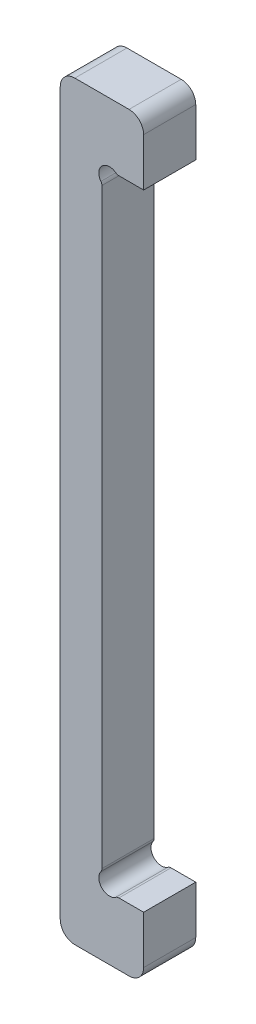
from build123d import *

# Parameters (mm, degrees)
BOSS_EXTRU_2_DEPTH = 25
CONG_1_R           = 7


with BuildPart() as part:
    # Esquisse2 → Boss.-Extru.2 (new body)
    with BuildSketch(Plane.XY):
        with BuildLine():
            Line((40, 150), (28.131040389, 150))
            ThreePointArc((28.131040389, 150), (27.347325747, 150.126017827), (26.642620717, 150.491366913))
            ThreePointArc((26.642620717, 150.491366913), (20, 150), (19.508633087, 143.357379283))
            ThreePointArc((19.508633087, 143.357379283), (19.873982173, 142.652674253), (20, 141.868959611))
            Line((20, 141.868959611), (20, 0))
            Line((20, 0), (0, 0))
            Line((0, 0), (0, 180))
            Line((0, 180), (40, 180))
            Line((40, 180), (40, 150))
        make_face()
    extrude(amount=BOSS_EXTRU_2_DEPTH)

    # Cong_1
    cong_1_edges = [part.edges().sort_by_distance(p)[0] for p in [
        (0, 180, 12.5),
        (40, 180, 12.5),
    ]]
    fillet(cong_1_edges, radius=CONG_1_R)

    # Mirror1: part across plane


with BuildPart() as part_1:
    add(part.part)
    add(part.part.mirror(Plane(origin=(20, 0, 25), x_dir=(0, 0, 1), z_dir=(0, 1, 0))))


solid = part_1.part
